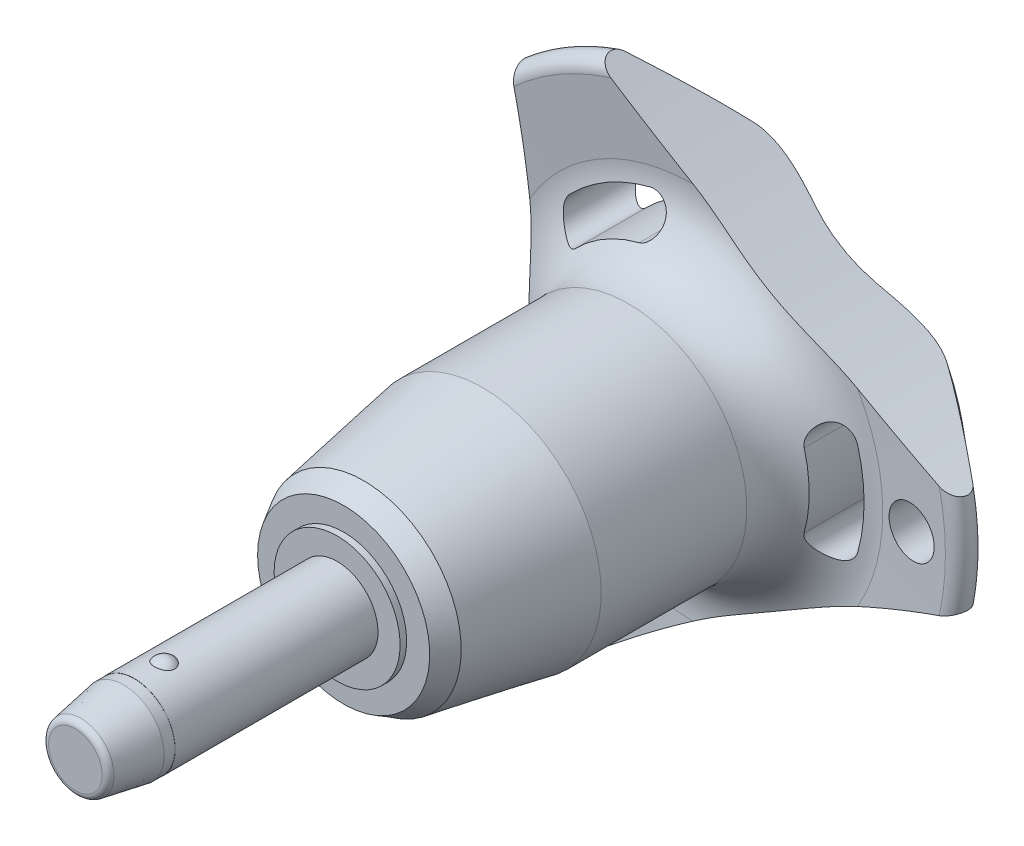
from build123d import *

# Parameters (mm, degrees)
SKETCH1_R           = 2.5
BOSS_EXTRUDE1_DEPTH = 10
SKETCH2_R           = 2.1
BOSS_EXTRUDE2_DEPTH = 26.7
BOSS_EXTRUDE3_START = 6
SKETCH1_2_R         = 2.5
BOSS_EXTRUDE3_DEPTH = 6
CHAMFER1_SIZE       = 3
CHAMFER1_SIZE2      = 0.528980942
FILLET1_R           = 0.4
SKETCH6_R           = 79.96
CUT_EXTRUDE1_DEPTH  = 44.566782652
CIRPATTERN1_COUNT   = 3
SKETCH7_R           = 1.5
CUT_EXTRUDE2_DEPTH  = 44.216000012
SKETCH8_R           = 2.5
SKETCH8_R_2         = 2.49
CUT_EXTRUDE3_DEPTH  = 3.6


with BuildPart() as part:
    # Sketch1 → Boss-Extrude1 (new body)
    with BuildSketch(Plane.XY):
        Circle(SKETCH1_R)
    extrude(amount=-BOSS_EXTRUDE1_DEPTH)

    # Sketch2 → Boss-Extrude2 (add)
    with BuildSketch(Plane(origin=(0, 0, -10), x_dir=(-1, 0, 0), z_dir=(0, 0, -1))):
        Circle(SKETCH2_R)
    extrude(amount=BOSS_EXTRUDE2_DEPTH)

    # Sketch3 → Revolve1 (revolve)
    with BuildSketch(Plane(origin=(0, 0, 0), x_dir=(0, 0, -1), z_dir=(1, 0, 0))):
        with BuildLine():
            Line((-0.580947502, 2.75), (-0.580947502, 1.15))
            ThreePointArc((-0.580947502, 1.15), (0.219052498, 1.95), (-0.580947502, 2.75))
        make_face()
        with BuildLine():
            Line((-0.580947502, -1.15), (-0.580947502, -2.75))
            ThreePointArc((-0.580947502, -2.75), (0.219052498, -1.95), (-0.580947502, -1.15))
        make_face()
    revolve(axis=Axis((0, -1.15, 0.580947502), (0, 1, 0)))

    # Sketch1_2 → Boss-Extrude3 (add)
    with BuildSketch(Plane.XY.offset(BOSS_EXTRUDE3_START)):
        Circle(SKETCH1_2_R)
    extrude(amount=-BOSS_EXTRUDE3_DEPTH)

    # Chamfer1
    chamfer1_edges = [part.edges().sort_by_distance(p)[0] for p in [
        (-2.5, 0, 6),
    ]]
    chamfer1_side = [part.faces().sort_by_distance(p)[0] for p in [
        (-2.5, 0, -2),
    ]]
    chamfer(chamfer1_edges, length=CHAMFER1_SIZE, length2=CHAMFER1_SIZE2, reference=chamfer1_side[0])

    # Fillet1
    fillet1_edges = [part.edges().sort_by_distance(p)[0] for p in [
        (-1.971019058, 0, 6),
        (2.1, 0, -36.7),
    ]]
    fillet(fillet1_edges, radius=FILLET1_R)

    # Sketch4 → Revolve2 (revolve)
    with BuildSketch(Plane(origin=(0, 0, 0), x_dir=(0, 0, -1), z_dir=(1, 0, 0)), mode=Mode.PRIVATE) as revolve2_sk:
        Polygon((10, 0), (10, 3.851837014), (10.4, 3.851837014), (10.4, 5.26161122), (11.620900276, 5.966498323), (18.9, 7.25), (27.8, 7.25), (27.8, 0), align=None)
    revolve(revolve2_sk.sketch.rotate(Axis((0, 0, -27.8), (0, 0, 1)), 90), axis=Axis((0, 0, -27.8), (0, 0, 1)))

    # Sketch5 → Revolve3 (revolve)
    with BuildSketch(Plane(origin=(0, 0, 0), x_dir=(0, 0, -1), z_dir=(1, 0, 0)), mode=Mode.PRIVATE) as revolve3_sk:
        with BuildLine():
            Line((31.78715932, 11.570250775), (31.452568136, 15.735949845))
            ThreePointArc((31.452568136, 15.735949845), (31.946485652, 16.540188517), (32.862835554, 16.314230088))
            Line((32.862835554, 16.314230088), (36.326414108, 12.186497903))
            ThreePointArc((36.326414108, 12.186497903), (36.7, 11.109282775), (36.261488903, 10.056825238))
            ThreePointArc((36.261488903, 10.056825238), (33.289873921, 5.413681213), (32.25, 0))
            Line((32.25, 0), (27.8, 0))
            Line((27.8, 0), (27.8, 7.25))
            ThreePointArc((27.8, 7.25), (30.739473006, 8.537160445), (31.78715932, 11.570250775))
        make_face()
    revolve(revolve3_sk.sketch.rotate(Axis((0, 0, -32.25), (0, 0, 1)), 90), axis=Axis((0, 0, -32.25), (0, 0, 1)))

    # Sketch6 → Cut-Extrude1 (cut, through all)
    with BuildSketch(Plane.XY):
        with Locations((-89.76, 0)):
            Circle(SKETCH6_R)
        with BuildLine():
            ThreePointArc((10.099921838, -2.834717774), (10.490188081, 0), (10.099921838, 2.834717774))
            ThreePointArc((10.099921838, 2.834717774), (8.768180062, 3.582738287), (8.020159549, 2.250996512))
            ThreePointArc((8.020159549, 2.250996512), (8.330062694, 0), (8.020159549, -2.250996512))
            ThreePointArc((8.020159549, -2.250996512), (8.768180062, -3.582738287), (10.099921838, -2.834717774))
        make_face()
    cut_extrude1 = extrude(amount=-CUT_EXTRUDE1_DEPTH, mode=Mode.SUBTRACT)

    # CirPattern1: Cut-Extrude1 ×3 about axis
    cirpattern1_axis = Axis((0, 0, 0), (0, 0, 1))
    for i in range(1, CIRPATTERN1_COUNT):
        add(cut_extrude1.rotate(cirpattern1_axis, i * 360 / CIRPATTERN1_COUNT), mode=Mode.SUBTRACT)

    # Sketch7 → Cut-Extrude2 (cut, through all)
    with BuildSketch(Plane.XY):
        with Locations(Location((13.490188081, 0, 0), (0, 0, 225.221865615))):
            Circle(SKETCH7_R)
    extrude(amount=-CUT_EXTRUDE2_DEPTH, mode=Mode.SUBTRACT)

    # Sketch8 → Cut-Extrude3 (cut)
    with BuildSketch(Plane.XY.offset(6)):
        Circle(SKETCH8_R)
        Circle(SKETCH8_R_2, mode=Mode.SUBTRACT)
    extrude(amount=-CUT_EXTRUDE3_DEPTH, mode=Mode.SUBTRACT)


solid = part.part
